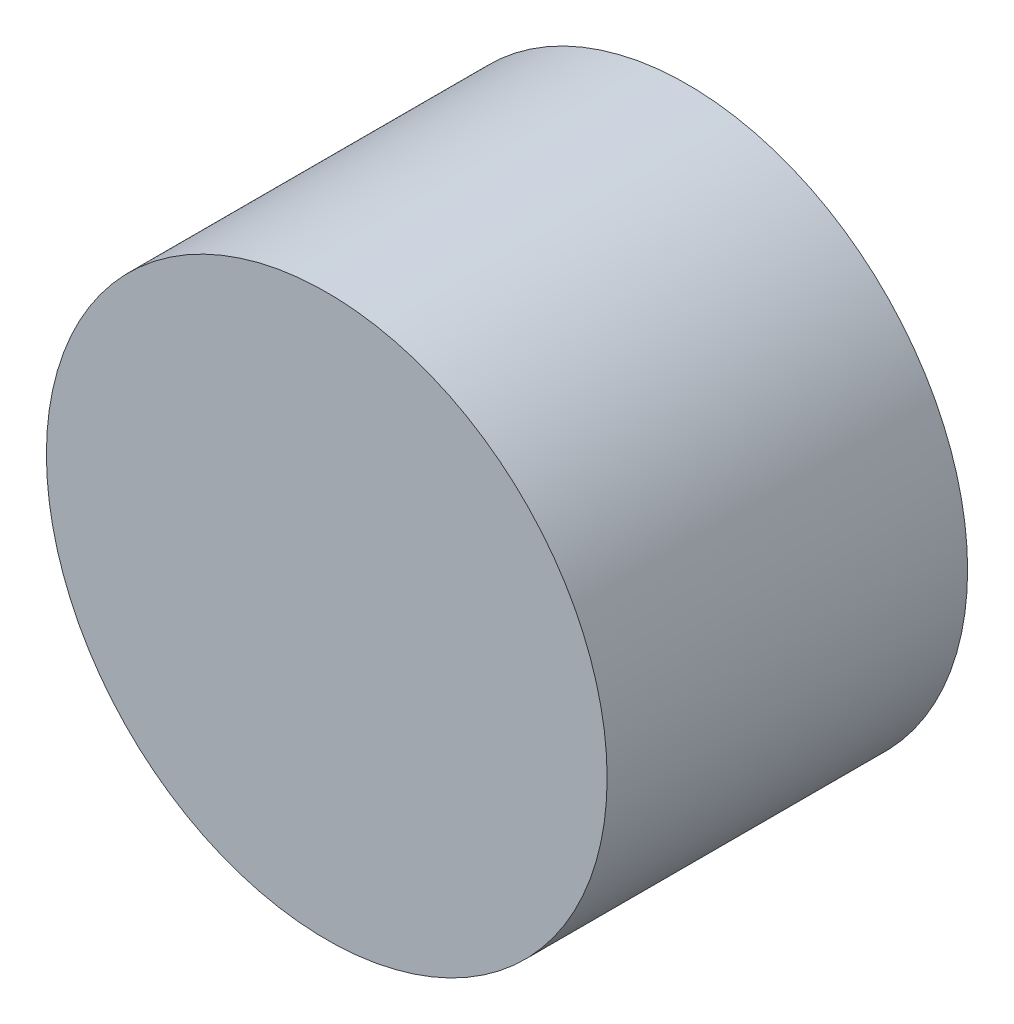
ISO-10303-21;
HEADER;
FILE_DESCRIPTION(('STEP AP214'),'2;1');
FILE_NAME('part.step','',(''),(''),'','','');
FILE_SCHEMA(('AUTOMOTIVE_DESIGN { 1 0 10303 214 1 1 1 1 }'));
ENDSEC;
DATA;
#1=APPLICATION_CONTEXT('core data for automotive mechanical design processes');
#2=APPLICATION_PROTOCOL_DEFINITION('international standard','automotive_design',2000,#1);
#3=PRODUCT_CONTEXT('',#1,'mechanical');
#4=PRODUCT('Part','Part','',(#3));
#5=PRODUCT_RELATED_PRODUCT_CATEGORY('part','',(#4));
#6=PRODUCT_DEFINITION_FORMATION('','',#4);
#7=PRODUCT_DEFINITION_CONTEXT('part definition',#1,'design');
#8=PRODUCT_DEFINITION('design','',#6,#7);
#9=PRODUCT_DEFINITION_SHAPE('','',#8);
#10=(LENGTH_UNIT() NAMED_UNIT(*) SI_UNIT(.MILLI.,.METRE.));
#11=(NAMED_UNIT(*) PLANE_ANGLE_UNIT() SI_UNIT($,.RADIAN.));
#12=(NAMED_UNIT(*) SI_UNIT($,.STERADIAN.) SOLID_ANGLE_UNIT());
#13=UNCERTAINTY_MEASURE_WITH_UNIT(LENGTH_MEASURE(1.E-05),#10,'distance_accuracy_value','');
#14=(GEOMETRIC_REPRESENTATION_CONTEXT(3) GLOBAL_UNCERTAINTY_ASSIGNED_CONTEXT((#13)) GLOBAL_UNIT_ASSIGNED_CONTEXT((#10,
#11,#12)) REPRESENTATION_CONTEXT('',''));
#15=CARTESIAN_POINT('',(0.,0.,0.));
#16=DIRECTION('',(0.,0.,1.));
#17=DIRECTION('',(1.,0.,0.));
#18=AXIS2_PLACEMENT_3D('',#15,#16,#17);
#19=CARTESIAN_POINT('',(0.,0.,9.));
#20=DIRECTION('',(0.,0.,-1.));
#21=DIRECTION('',(-1.,0.,0.));
#22=AXIS2_PLACEMENT_3D('',#19,#20,#21);
#23=CYLINDRICAL_SURFACE('',#22,7.);
#24=CARTESIAN_POINT('',(0.,0.,9.));
#25=DIRECTION('',(0.,0.,1.));
#26=DIRECTION('',(1.,0.,0.));
#27=AXIS2_PLACEMENT_3D('',#24,#25,#26);
#28=CIRCLE('',#27,7.);
#29=CARTESIAN_POINT('',(7.,0.,9.));
#30=VERTEX_POINT('',#29);
#31=EDGE_CURVE('E10',#30,#30,#28,.T.);
#32=ORIENTED_EDGE('',*,*,#31,.F.);
#33=EDGE_LOOP('',(#32));
#34=FACE_BOUND('',#33,.T.);
#35=CARTESIAN_POINT('',(0.,0.,0.));
#36=DIRECTION('',(0.,0.,1.));
#37=DIRECTION('',(1.,0.,0.));
#38=AXIS2_PLACEMENT_3D('',#35,#36,#37);
#39=CIRCLE('',#38,7.);
#40=CARTESIAN_POINT('',(7.,0.,0.));
#41=VERTEX_POINT('',#40);
#42=EDGE_CURVE('E37',#41,#41,#39,.T.);
#43=ORIENTED_EDGE('',*,*,#42,.T.);
#44=EDGE_LOOP('',(#43));
#45=FACE_BOUND('',#44,.T.);
#46=ADVANCED_FACE('F34',(#34,#45),#23,.T.);
#47=CARTESIAN_POINT('',(0.,0.,9.));
#48=DIRECTION('',(0.,0.,1.));
#49=DIRECTION('',(1.,0.,0.));
#50=AXIS2_PLACEMENT_3D('',#47,#48,#49);
#51=PLANE('',#50);
#52=ORIENTED_EDGE('',*,*,#31,.T.);
#53=EDGE_LOOP('',(#52));
#54=FACE_BOUND('',#53,.T.);
#55=ADVANCED_FACE('F49',(#54),#51,.T.);
#56=CARTESIAN_POINT('',(0.,0.,0.));
#57=DIRECTION('',(0.,0.,1.));
#58=DIRECTION('',(1.,0.,0.));
#59=AXIS2_PLACEMENT_3D('',#56,#57,#58);
#60=PLANE('',#59);
#61=ORIENTED_EDGE('',*,*,#42,.F.);
#62=EDGE_LOOP('',(#61));
#63=FACE_BOUND('',#62,.T.);
#64=ADVANCED_FACE('F47',(#63),#60,.F.);
#65=CLOSED_SHELL('',(#46,#55,#64));
#66=MANIFOLD_SOLID_BREP('B2',#65);
#67=ADVANCED_BREP_SHAPE_REPRESENTATION('',(#18,#66),#14);
#68=SHAPE_DEFINITION_REPRESENTATION(#9,#67);
ENDSEC;
END-ISO-10303-21;
